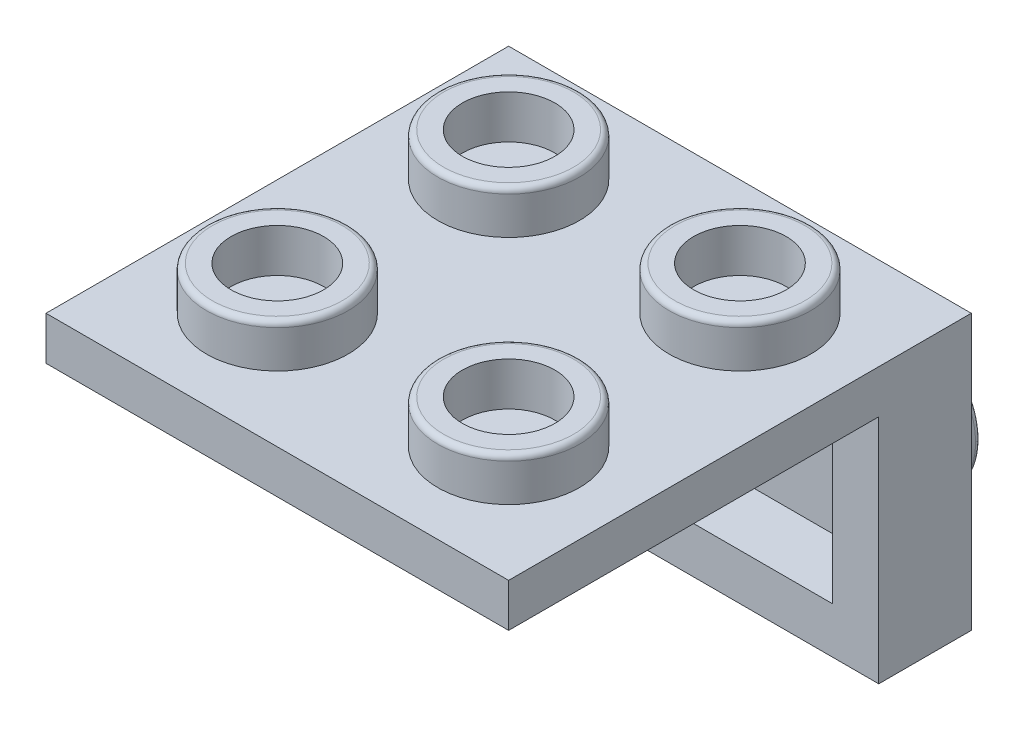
ISO-10303-21;
HEADER;
FILE_DESCRIPTION(('STEP AP214'),'2;1');
FILE_NAME('part.step','',(''),(''),'','','');
FILE_SCHEMA(('AUTOMOTIVE_DESIGN { 1 0 10303 214 1 1 1 1 }'));
ENDSEC;
DATA;
#1=APPLICATION_CONTEXT('core data for automotive mechanical design processes');
#2=APPLICATION_PROTOCOL_DEFINITION('international standard','automotive_design',2000,#1);
#3=PRODUCT_CONTEXT('',#1,'mechanical');
#4=PRODUCT('Part','Part','',(#3));
#5=PRODUCT_RELATED_PRODUCT_CATEGORY('part','',(#4));
#6=PRODUCT_DEFINITION_FORMATION('','',#4);
#7=PRODUCT_DEFINITION_CONTEXT('part definition',#1,'design');
#8=PRODUCT_DEFINITION('design','',#6,#7);
#9=PRODUCT_DEFINITION_SHAPE('','',#8);
#10=(LENGTH_UNIT() NAMED_UNIT(*) SI_UNIT(.MILLI.,.METRE.));
#11=(NAMED_UNIT(*) PLANE_ANGLE_UNIT() SI_UNIT($,.RADIAN.));
#12=(NAMED_UNIT(*) SI_UNIT($,.STERADIAN.) SOLID_ANGLE_UNIT());
#13=UNCERTAINTY_MEASURE_WITH_UNIT(LENGTH_MEASURE(1.E-05),#10,'distance_accuracy_value','');
#14=(GEOMETRIC_REPRESENTATION_CONTEXT(3) GLOBAL_UNCERTAINTY_ASSIGNED_CONTEXT((#13)) GLOBAL_UNIT_ASSIGNED_CONTEXT((#10,
#11,#12)) REPRESENTATION_CONTEXT('',''));
#15=CARTESIAN_POINT('',(0.,0.,0.));
#16=DIRECTION('',(0.,0.,1.));
#17=DIRECTION('',(1.,0.,0.));
#18=AXIS2_PLACEMENT_3D('',#15,#16,#17);
#19=CARTESIAN_POINT('',(-16.,1.5,0.));
#20=DIRECTION('',(0.,1.,0.));
#21=DIRECTION('',(-1.,0.,0.));
#22=AXIS2_PLACEMENT_3D('',#19,#20,#21);
#23=PLANE('',#22);
#24=DIRECTION('',(0.,0.,1.));
#25=VECTOR('',#24,1.);
#26=CARTESIAN_POINT('',(-16.,1.5,0.));
#27=LINE('',#26,#25);
#28=CARTESIAN_POINT('',(-16.,1.5,0.));
#29=VERTEX_POINT('',#28);
#30=CARTESIAN_POINT('',(-16.,1.5,16.));
#31=VERTEX_POINT('',#30);
#32=EDGE_CURVE('E146',#29,#31,#27,.T.);
#33=ORIENTED_EDGE('',*,*,#32,.T.);
#34=DIRECTION('',(1.,0.,0.));
#35=VECTOR('',#34,1.);
#36=CARTESIAN_POINT('',(-16.,1.5,16.));
#37=LINE('',#36,#35);
#38=CARTESIAN_POINT('',(0.,1.5,16.));
#39=VERTEX_POINT('',#38);
#40=EDGE_CURVE('E127',#31,#39,#37,.T.);
#41=ORIENTED_EDGE('',*,*,#40,.T.);
#42=DIRECTION('',(0.,0.,-1.));
#43=VECTOR('',#42,1.);
#44=CARTESIAN_POINT('',(0.,1.5,0.));
#45=LINE('',#44,#43);
#46=CARTESIAN_POINT('',(0.,1.5,0.));
#47=VERTEX_POINT('',#46);
#48=EDGE_CURVE('E149',#39,#47,#45,.T.);
#49=ORIENTED_EDGE('',*,*,#48,.T.);
#50=DIRECTION('',(-1.,0.,0.));
#51=VECTOR('',#50,1.);
#52=CARTESIAN_POINT('',(-16.,1.5,0.));
#53=LINE('',#52,#51);
#54=EDGE_CURVE('E135',#47,#29,#53,.T.);
#55=ORIENTED_EDGE('',*,*,#54,.T.);
#56=EDGE_LOOP('',(#33,#41,#49,#55));
#57=FACE_BOUND('',#56,.T.);
#58=CARTESIAN_POINT('',(-12.,1.5,4.));
#59=DIRECTION('',(0.,1.,0.));
#60=DIRECTION('',(-1.,0.,0.));
#61=AXIS2_PLACEMENT_3D('',#58,#59,#60);
#62=CIRCLE('',#61,2.45);
#63=CARTESIAN_POINT('',(-14.45,1.5,4.));
#64=VERTEX_POINT('',#63);
#65=EDGE_CURVE('E116',#64,#64,#62,.T.);
#66=ORIENTED_EDGE('',*,*,#65,.F.);
#67=EDGE_LOOP('',(#66));
#68=FACE_BOUND('',#67,.T.);
#69=CARTESIAN_POINT('',(-12.,1.5,12.));
#70=DIRECTION('',(0.,1.,0.));
#71=DIRECTION('',(-1.,0.,0.));
#72=AXIS2_PLACEMENT_3D('',#69,#70,#71);
#73=CIRCLE('',#72,2.45);
#74=CARTESIAN_POINT('',(-14.45,1.5,12.));
#75=VERTEX_POINT('',#74);
#76=EDGE_CURVE('E647',#75,#75,#73,.T.);
#77=ORIENTED_EDGE('',*,*,#76,.F.);
#78=EDGE_LOOP('',(#77));
#79=FACE_BOUND('',#78,.T.);
#80=CARTESIAN_POINT('',(-4.,1.5,4.));
#81=DIRECTION('',(0.,1.,0.));
#82=DIRECTION('',(-1.,0.,0.));
#83=AXIS2_PLACEMENT_3D('',#80,#81,#82);
#84=CIRCLE('',#83,2.45);
#85=CARTESIAN_POINT('',(-6.45,1.5,4.));
#86=VERTEX_POINT('',#85);
#87=EDGE_CURVE('E648',#86,#86,#84,.T.);
#88=ORIENTED_EDGE('',*,*,#87,.F.);
#89=EDGE_LOOP('',(#88));
#90=FACE_BOUND('',#89,.T.);
#91=CARTESIAN_POINT('',(-4.,1.5,12.));
#92=DIRECTION('',(0.,1.,0.));
#93=DIRECTION('',(-1.,0.,0.));
#94=AXIS2_PLACEMENT_3D('',#91,#92,#93);
#95=CIRCLE('',#94,2.45);
#96=CARTESIAN_POINT('',(-6.45,1.5,12.));
#97=VERTEX_POINT('',#96);
#98=EDGE_CURVE('E669',#97,#97,#95,.T.);
#99=ORIENTED_EDGE('',*,*,#98,.F.);
#100=EDGE_LOOP('',(#99));
#101=FACE_BOUND('',#100,.T.);
#102=ADVANCED_FACE('F27',(#57,#68,#79,#90,#101),#23,.T.);
#103=CARTESIAN_POINT('',(-1.6,-1.6,1.1));
#104=DIRECTION('',(0.,0.,1.));
#105=DIRECTION('',(1.,0.,0.));
#106=AXIS2_PLACEMENT_3D('',#103,#104,#105);
#107=PLANE('',#106);
#108=DIRECTION('',(0.,1.,0.));
#109=VECTOR('',#108,1.);
#110=CARTESIAN_POINT('',(-1.6,-6.4,1.1));
#111=LINE('',#110,#109);
#112=CARTESIAN_POINT('',(-1.6,-6.4,1.1));
#113=VERTEX_POINT('',#112);
#114=CARTESIAN_POINT('',(-1.6,-1.6,1.1));
#115=VERTEX_POINT('',#114);
#116=EDGE_CURVE('E414',#113,#115,#111,.T.);
#117=ORIENTED_EDGE('',*,*,#116,.T.);
#118=DIRECTION('',(-1.,0.,0.));
#119=VECTOR('',#118,1.);
#120=CARTESIAN_POINT('',(-1.6,-1.6,1.1));
#121=LINE('',#120,#119);
#122=CARTESIAN_POINT('',(-14.4,-1.6,1.1));
#123=VERTEX_POINT('',#122);
#124=EDGE_CURVE('E411',#115,#123,#121,.T.);
#125=ORIENTED_EDGE('',*,*,#124,.T.);
#126=DIRECTION('',(0.,-1.,0.));
#127=VECTOR('',#126,1.);
#128=CARTESIAN_POINT('',(-14.4,-6.4,1.1));
#129=LINE('',#128,#127);
#130=CARTESIAN_POINT('',(-14.4,-6.4,1.1));
#131=VERTEX_POINT('',#130);
#132=EDGE_CURVE('E408',#123,#131,#129,.T.);
#133=ORIENTED_EDGE('',*,*,#132,.T.);
#134=DIRECTION('',(1.,0.,0.));
#135=VECTOR('',#134,1.);
#136=CARTESIAN_POINT('',(-1.6,-6.4,1.1));
#137=LINE('',#136,#135);
#138=EDGE_CURVE('E403',#131,#113,#137,.T.);
#139=ORIENTED_EDGE('',*,*,#138,.T.);
#140=EDGE_LOOP('',(#117,#125,#133,#139));
#141=FACE_BOUND('',#140,.T.);
#142=CARTESIAN_POINT('',(-7.9128281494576,-3.82752633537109,1.1));
#143=DIRECTION('',(0.,0.,1.));
#144=DIRECTION('',(1.,0.,0.));
#145=AXIS2_PLACEMENT_3D('',#142,#143,#144);
#146=CIRCLE('',#145,1.5);
#147=CARTESIAN_POINT('',(-6.4128281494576,-3.82752633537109,1.1));
#148=VERTEX_POINT('',#147);
#149=EDGE_CURVE('E133',#148,#148,#146,.T.);
#150=ORIENTED_EDGE('',*,*,#149,.F.);
#151=EDGE_LOOP('',(#150));
#152=FACE_BOUND('',#151,.T.);
#153=ADVANCED_FACE('F240',(#141,#152),#107,.T.);
#154=CARTESIAN_POINT('',(0.,0.,0.));
#155=DIRECTION('',(0.,0.,-1.));
#156=DIRECTION('',(-1.,0.,0.));
#157=AXIS2_PLACEMENT_3D('',#154,#155,#156);
#158=PLANE('',#157);
#159=CARTESIAN_POINT('',(-4.,-4.,0.));
#160=DIRECTION('',(0.,0.,-1.));
#161=DIRECTION('',(-1.,0.,0.));
#162=AXIS2_PLACEMENT_3D('',#159,#160,#161);
#163=CIRCLE('',#162,2.45);
#164=CARTESIAN_POINT('',(-1.55,-4.,0.));
#165=VERTEX_POINT('',#164);
#166=EDGE_CURVE('E427',#165,#165,#163,.T.);
#167=ORIENTED_EDGE('',*,*,#166,.F.);
#168=EDGE_LOOP('',(#167));
#169=FACE_BOUND('',#168,.T.);
#170=DIRECTION('',(0.,1.,0.));
#171=VECTOR('',#170,1.);
#172=CARTESIAN_POINT('',(0.,0.,0.));
#173=LINE('',#172,#171);
#174=CARTESIAN_POINT('',(0.,-8.,0.));
#175=VERTEX_POINT('',#174);
#176=EDGE_CURVE('E163',#175,#47,#173,.T.);
#177=ORIENTED_EDGE('',*,*,#176,.F.);
#178=DIRECTION('',(1.,0.,0.));
#179=VECTOR('',#178,1.);
#180=CARTESIAN_POINT('',(0.,-8.,0.));
#181=LINE('',#180,#179);
#182=CARTESIAN_POINT('',(-16.,-8.,0.));
#183=VERTEX_POINT('',#182);
#184=EDGE_CURVE('E162',#183,#175,#181,.T.);
#185=ORIENTED_EDGE('',*,*,#184,.F.);
#186=DIRECTION('',(0.,-1.,0.));
#187=VECTOR('',#186,1.);
#188=CARTESIAN_POINT('',(-16.,0.,0.));
#189=LINE('',#188,#187);
#190=EDGE_CURVE('E158',#29,#183,#189,.T.);
#191=ORIENTED_EDGE('',*,*,#190,.F.);
#192=ORIENTED_EDGE('',*,*,#54,.F.);
#193=EDGE_LOOP('',(#177,#185,#191,#192));
#194=FACE_BOUND('',#193,.T.);
#195=CARTESIAN_POINT('',(-12.,-4.,0.));
#196=DIRECTION('',(0.,0.,-1.));
#197=DIRECTION('',(-1.,0.,0.));
#198=AXIS2_PLACEMENT_3D('',#195,#196,#197);
#199=CIRCLE('',#198,2.45);
#200=CARTESIAN_POINT('',(-9.55,-4.,0.));
#201=VERTEX_POINT('',#200);
#202=EDGE_CURVE('E436',#201,#201,#199,.T.);
#203=ORIENTED_EDGE('',*,*,#202,.F.);
#204=EDGE_LOOP('',(#203));
#205=FACE_BOUND('',#204,.T.);
#206=ADVANCED_FACE('F171',(#169,#194,#205),#158,.T.);
#207=CARTESIAN_POINT('',(0.,0.,3.2));
#208=DIRECTION('',(-1.,0.,0.));
#209=DIRECTION('',(0.,-1.,0.));
#210=AXIS2_PLACEMENT_3D('',#207,#208,#209);
#211=PLANE('',#210);
#212=ORIENTED_EDGE('',*,*,#176,.T.);
#213=ORIENTED_EDGE('',*,*,#48,.F.);
#214=DIRECTION('',(0.,-1.,0.));
#215=VECTOR('',#214,1.);
#216=CARTESIAN_POINT('',(0.,1.5,16.));
#217=LINE('',#216,#215);
#218=CARTESIAN_POINT('',(0.,0.,16.));
#219=VERTEX_POINT('',#218);
#220=EDGE_CURVE('E130',#39,#219,#217,.T.);
#221=ORIENTED_EDGE('',*,*,#220,.T.);
#222=DIRECTION('',(0.,0.,-1.));
#223=VECTOR('',#222,1.);
#224=CARTESIAN_POINT('',(0.,0.,0.));
#225=LINE('',#224,#223);
#226=CARTESIAN_POINT('',(0.,0.,3.2));
#227=VERTEX_POINT('',#226);
#228=EDGE_CURVE('E121',#219,#227,#225,.T.);
#229=ORIENTED_EDGE('',*,*,#228,.T.);
#230=DIRECTION('',(0.,1.,0.));
#231=VECTOR('',#230,1.);
#232=CARTESIAN_POINT('',(0.,0.,3.2));
#233=LINE('',#232,#231);
#234=CARTESIAN_POINT('',(0.,-8.,3.2));
#235=VERTEX_POINT('',#234);
#236=EDGE_CURVE('E173',#235,#227,#233,.T.);
#237=ORIENTED_EDGE('',*,*,#236,.F.);
#238=DIRECTION('',(0.,0.,-1.));
#239=VECTOR('',#238,1.);
#240=CARTESIAN_POINT('',(0.,-8.,3.2));
#241=LINE('',#240,#239);
#242=EDGE_CURVE('E169',#235,#175,#241,.T.);
#243=ORIENTED_EDGE('',*,*,#242,.T.);
#244=EDGE_LOOP('',(#212,#213,#221,#229,#237,#243));
#245=FACE_BOUND('',#244,.T.);
#246=ADVANCED_FACE('F29',(#245),#211,.F.);
#247=CARTESIAN_POINT('',(-16.,0.,3.2));
#248=DIRECTION('',(1.,0.,0.));
#249=DIRECTION('',(0.,0.,-1.));
#250=AXIS2_PLACEMENT_3D('',#247,#248,#249);
#251=PLANE('',#250);
#252=ORIENTED_EDGE('',*,*,#190,.T.);
#253=DIRECTION('',(0.,0.,-1.));
#254=VECTOR('',#253,1.);
#255=CARTESIAN_POINT('',(-16.,-8.,3.2));
#256=LINE('',#255,#254);
#257=CARTESIAN_POINT('',(-16.,-8.,3.2));
#258=VERTEX_POINT('',#257);
#259=EDGE_CURVE('E160',#258,#183,#256,.T.);
#260=ORIENTED_EDGE('',*,*,#259,.F.);
#261=DIRECTION('',(0.,-1.,0.));
#262=VECTOR('',#261,1.);
#263=CARTESIAN_POINT('',(-16.,0.,3.2));
#264=LINE('',#263,#262);
#265=CARTESIAN_POINT('',(-16.,0.,3.2));
#266=VERTEX_POINT('',#265);
#267=EDGE_CURVE('E112',#266,#258,#264,.T.);
#268=ORIENTED_EDGE('',*,*,#267,.F.);
#269=DIRECTION('',(0.,0.,1.));
#270=VECTOR('',#269,1.);
#271=CARTESIAN_POINT('',(-16.,0.,0.));
#272=LINE('',#271,#270);
#273=CARTESIAN_POINT('',(-16.,0.,16.));
#274=VERTEX_POINT('',#273);
#275=EDGE_CURVE('E105',#266,#274,#272,.T.);
#276=ORIENTED_EDGE('',*,*,#275,.T.);
#277=DIRECTION('',(0.,-1.,0.));
#278=VECTOR('',#277,1.);
#279=CARTESIAN_POINT('',(-16.,1.5,16.));
#280=LINE('',#279,#278);
#281=EDGE_CURVE('E110',#31,#274,#280,.T.);
#282=ORIENTED_EDGE('',*,*,#281,.F.);
#283=ORIENTED_EDGE('',*,*,#32,.F.);
#284=EDGE_LOOP('',(#252,#260,#268,#276,#282,#283));
#285=FACE_BOUND('',#284,.T.);
#286=ADVANCED_FACE('F107',(#285),#251,.F.);
#287=CARTESIAN_POINT('',(0.,-8.,3.2));
#288=DIRECTION('',(0.,1.,0.));
#289=DIRECTION('',(-1.,0.,0.));
#290=AXIS2_PLACEMENT_3D('',#287,#288,#289);
#291=PLANE('',#290);
#292=ORIENTED_EDGE('',*,*,#184,.T.);
#293=ORIENTED_EDGE('',*,*,#242,.F.);
#294=DIRECTION('',(1.,0.,0.));
#295=VECTOR('',#294,1.);
#296=CARTESIAN_POINT('',(0.,-8.,3.2));
#297=LINE('',#296,#295);
#298=EDGE_CURVE('E50',#258,#235,#297,.T.);
#299=ORIENTED_EDGE('',*,*,#298,.F.);
#300=ORIENTED_EDGE('',*,*,#259,.T.);
#301=EDGE_LOOP('',(#292,#293,#299,#300));
#302=FACE_BOUND('',#301,.T.);
#303=ADVANCED_FACE('F166',(#302),#291,.F.);
#304=CARTESIAN_POINT('',(0.,0.,3.2));
#305=DIRECTION('',(0.,0.,-1.));
#306=DIRECTION('',(-1.,0.,0.));
#307=AXIS2_PLACEMENT_3D('',#304,#305,#306);
#308=PLANE('',#307);
#309=DIRECTION('',(-1.,0.,0.));
#310=VECTOR('',#309,1.);
#311=CARTESIAN_POINT('',(-1.6,-1.6,3.2));
#312=LINE('',#311,#310);
#313=CARTESIAN_POINT('',(-1.6,-1.6,3.2));
#314=VERTEX_POINT('',#313);
#315=CARTESIAN_POINT('',(-14.4,-1.6,3.2));
#316=VERTEX_POINT('',#315);
#317=EDGE_CURVE('E423',#314,#316,#312,.T.);
#318=ORIENTED_EDGE('',*,*,#317,.F.);
#319=DIRECTION('',(0.,1.,0.));
#320=VECTOR('',#319,1.);
#321=CARTESIAN_POINT('',(-1.6,-6.4,3.2));
#322=LINE('',#321,#320);
#323=CARTESIAN_POINT('',(-1.6,-6.4,3.2));
#324=VERTEX_POINT('',#323);
#325=EDGE_CURVE('E42',#324,#314,#322,.T.);
#326=ORIENTED_EDGE('',*,*,#325,.F.);
#327=DIRECTION('',(1.,0.,0.));
#328=VECTOR('',#327,1.);
#329=CARTESIAN_POINT('',(-1.6,-6.4,3.2));
#330=LINE('',#329,#328);
#331=CARTESIAN_POINT('',(-14.4,-6.4,3.2));
#332=VERTEX_POINT('',#331);
#333=EDGE_CURVE('E417',#332,#324,#330,.T.);
#334=ORIENTED_EDGE('',*,*,#333,.F.);
#335=DIRECTION('',(0.,-1.,0.));
#336=VECTOR('',#335,1.);
#337=CARTESIAN_POINT('',(-14.4,-6.4,3.2));
#338=LINE('',#337,#336);
#339=EDGE_CURVE('E420',#316,#332,#338,.T.);
#340=ORIENTED_EDGE('',*,*,#339,.F.);
#341=EDGE_LOOP('',(#318,#326,#334,#340));
#342=FACE_BOUND('',#341,.T.);
#343=ORIENTED_EDGE('',*,*,#236,.T.);
#344=DIRECTION('',(-1.,0.,0.));
#345=VECTOR('',#344,1.);
#346=CARTESIAN_POINT('',(0.,0.,3.2));
#347=LINE('',#346,#345);
#348=EDGE_CURVE('E175',#227,#266,#347,.T.);
#349=ORIENTED_EDGE('',*,*,#348,.T.);
#350=ORIENTED_EDGE('',*,*,#267,.T.);
#351=ORIENTED_EDGE('',*,*,#298,.T.);
#352=EDGE_LOOP('',(#343,#349,#350,#351));
#353=FACE_BOUND('',#352,.T.);
#354=ADVANCED_FACE('F381',(#342,#353),#308,.F.);
#355=CARTESIAN_POINT('',(-1.6,-6.4,1.1));
#356=DIRECTION('',(1.,0.,0.));
#357=DIRECTION('',(0.,0.,-1.));
#358=AXIS2_PLACEMENT_3D('',#355,#356,#357);
#359=PLANE('',#358);
#360=ORIENTED_EDGE('',*,*,#325,.T.);
#361=DIRECTION('',(0.,0.,1.));
#362=VECTOR('',#361,1.);
#363=CARTESIAN_POINT('',(-1.6,-1.6,1.1));
#364=LINE('',#363,#362);
#365=EDGE_CURVE('E400',#115,#314,#364,.T.);
#366=ORIENTED_EDGE('',*,*,#365,.F.);
#367=ORIENTED_EDGE('',*,*,#116,.F.);
#368=DIRECTION('',(0.,0.,1.));
#369=VECTOR('',#368,1.);
#370=CARTESIAN_POINT('',(-1.6,-6.4,1.1));
#371=LINE('',#370,#369);
#372=EDGE_CURVE('E396',#113,#324,#371,.T.);
#373=ORIENTED_EDGE('',*,*,#372,.T.);
#374=EDGE_LOOP('',(#360,#366,#367,#373));
#375=FACE_BOUND('',#374,.T.);
#376=ADVANCED_FACE('F371',(#375),#359,.F.);
#377=CARTESIAN_POINT('',(-1.6,-6.4,1.1));
#378=DIRECTION('',(0.,-1.,0.));
#379=DIRECTION('',(1.,0.,0.));
#380=AXIS2_PLACEMENT_3D('',#377,#378,#379);
#381=PLANE('',#380);
#382=ORIENTED_EDGE('',*,*,#333,.T.);
#383=ORIENTED_EDGE('',*,*,#372,.F.);
#384=ORIENTED_EDGE('',*,*,#138,.F.);
#385=DIRECTION('',(0.,0.,1.));
#386=VECTOR('',#385,1.);
#387=CARTESIAN_POINT('',(-14.4,-6.4,1.1));
#388=LINE('',#387,#386);
#389=EDGE_CURVE('E397',#131,#332,#388,.T.);
#390=ORIENTED_EDGE('',*,*,#389,.T.);
#391=EDGE_LOOP('',(#382,#383,#384,#390));
#392=FACE_BOUND('',#391,.T.);
#393=ADVANCED_FACE('F367',(#392),#381,.F.);
#394=CARTESIAN_POINT('',(-14.4,-6.4,1.1));
#395=DIRECTION('',(-1.,0.,0.));
#396=DIRECTION('',(0.,-1.,0.));
#397=AXIS2_PLACEMENT_3D('',#394,#395,#396);
#398=PLANE('',#397);
#399=ORIENTED_EDGE('',*,*,#339,.T.);
#400=ORIENTED_EDGE('',*,*,#389,.F.);
#401=ORIENTED_EDGE('',*,*,#132,.F.);
#402=DIRECTION('',(0.,0.,1.));
#403=VECTOR('',#402,1.);
#404=CARTESIAN_POINT('',(-14.4,-1.6,1.1));
#405=LINE('',#404,#403);
#406=EDGE_CURVE('E402',#123,#316,#405,.T.);
#407=ORIENTED_EDGE('',*,*,#406,.T.);
#408=EDGE_LOOP('',(#399,#400,#401,#407));
#409=FACE_BOUND('',#408,.T.);
#410=ADVANCED_FACE('F370',(#409),#398,.F.);
#411=CARTESIAN_POINT('',(-1.6,-1.6,1.1));
#412=DIRECTION('',(0.,1.,0.));
#413=DIRECTION('',(-1.,0.,0.));
#414=AXIS2_PLACEMENT_3D('',#411,#412,#413);
#415=PLANE('',#414);
#416=ORIENTED_EDGE('',*,*,#317,.T.);
#417=ORIENTED_EDGE('',*,*,#406,.F.);
#418=ORIENTED_EDGE('',*,*,#124,.F.);
#419=ORIENTED_EDGE('',*,*,#365,.T.);
#420=EDGE_LOOP('',(#416,#417,#418,#419));
#421=FACE_BOUND('',#420,.T.);
#422=ADVANCED_FACE('F364',(#421),#415,.F.);
#423=CARTESIAN_POINT('',(-4.,-4.,-1.9));
#424=DIRECTION('',(0.,0.,1.));
#425=DIRECTION('',(1.,0.,0.));
#426=AXIS2_PLACEMENT_3D('',#423,#424,#425);
#427=CYLINDRICAL_SURFACE('',#426,2.45);
#428=CARTESIAN_POINT('',(-4.,-4.,-1.7));
#429=DIRECTION('',(0.,0.,-1.));
#430=DIRECTION('',(-1.,0.,0.));
#431=AXIS2_PLACEMENT_3D('',#428,#429,#430);
#432=CIRCLE('',#431,2.45);
#433=CARTESIAN_POINT('',(-1.55,-4.,-1.7));
#434=VERTEX_POINT('',#433);
#435=EDGE_CURVE('E452',#434,#434,#432,.F.);
#436=CARTESIAN_POINT('',(-1.55,-4.,-1.7));
#437=CARTESIAN_POINT('',(-1.55,-4.,-1.68229166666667));
#438=CARTESIAN_POINT('',(-1.55,-4.,-1.66458333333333));
#439=CARTESIAN_POINT('',(-1.55,-4.,-1.62916666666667));
#440=CARTESIAN_POINT('',(-1.55,-4.,-1.61145833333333));
#441=CARTESIAN_POINT('',(-1.55,-4.,-1.57604166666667));
#442=CARTESIAN_POINT('',(-1.55,-4.,-1.55833333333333));
#443=CARTESIAN_POINT('',(-1.55,-4.,-1.52291666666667));
#444=CARTESIAN_POINT('',(-1.55,-4.,-1.50520833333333));
#445=CARTESIAN_POINT('',(-1.55,-4.,-1.46979166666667));
#446=CARTESIAN_POINT('',(-1.55,-4.,-1.45208333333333));
#447=CARTESIAN_POINT('',(-1.55,-4.,-1.41666666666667));
#448=CARTESIAN_POINT('',(-1.55,-4.,-1.39895833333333));
#449=CARTESIAN_POINT('',(-1.55,-4.,-1.36354166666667));
#450=CARTESIAN_POINT('',(-1.55,-4.,-1.34583333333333));
#451=CARTESIAN_POINT('',(-1.55,-4.,-1.31041666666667));
#452=CARTESIAN_POINT('',(-1.55,-4.,-1.29270833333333));
#453=CARTESIAN_POINT('',(-1.55,-4.,-1.25729166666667));
#454=CARTESIAN_POINT('',(-1.55,-4.,-1.23958333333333));
#455=CARTESIAN_POINT('',(-1.55,-4.,-1.20416666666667));
#456=CARTESIAN_POINT('',(-1.55,-4.,-1.18645833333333));
#457=CARTESIAN_POINT('',(-1.55,-4.,-1.15104166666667));
#458=CARTESIAN_POINT('',(-1.55,-4.,-1.13333333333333));
#459=CARTESIAN_POINT('',(-1.55,-4.,-1.09791666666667));
#460=CARTESIAN_POINT('',(-1.55,-4.,-1.08020833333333));
#461=CARTESIAN_POINT('',(-1.55,-4.,-1.04479166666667));
#462=CARTESIAN_POINT('',(-1.55,-4.,-1.02708333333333));
#463=CARTESIAN_POINT('',(-1.55,-4.,-0.991666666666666));
#464=CARTESIAN_POINT('',(-1.55,-4.,-0.973958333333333));
#465=CARTESIAN_POINT('',(-1.55,-4.,-0.938541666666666));
#466=CARTESIAN_POINT('',(-1.55,-4.,-0.920833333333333));
#467=CARTESIAN_POINT('',(-1.55,-4.,-0.885416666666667));
#468=CARTESIAN_POINT('',(-1.55,-4.,-0.867708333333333));
#469=CARTESIAN_POINT('',(-1.55,-4.,-0.832291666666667));
#470=CARTESIAN_POINT('',(-1.55,-4.,-0.814583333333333));
#471=CARTESIAN_POINT('',(-1.55,-4.,-0.779166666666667));
#472=CARTESIAN_POINT('',(-1.55,-4.,-0.761458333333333));
#473=CARTESIAN_POINT('',(-1.55,-4.,-0.726041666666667));
#474=CARTESIAN_POINT('',(-1.55,-4.,-0.708333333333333));
#475=CARTESIAN_POINT('',(-1.55,-4.,-0.672916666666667));
#476=CARTESIAN_POINT('',(-1.55,-4.,-0.655208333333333));
#477=CARTESIAN_POINT('',(-1.55,-4.,-0.619791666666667));
#478=CARTESIAN_POINT('',(-1.55,-4.,-0.602083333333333));
#479=CARTESIAN_POINT('',(-1.55,-4.,-0.566666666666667));
#480=CARTESIAN_POINT('',(-1.55,-4.,-0.548958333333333));
#481=CARTESIAN_POINT('',(-1.55,-4.,-0.513541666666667));
#482=CARTESIAN_POINT('',(-1.55,-4.,-0.495833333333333));
#483=CARTESIAN_POINT('',(-1.55,-4.,-0.460416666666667));
#484=CARTESIAN_POINT('',(-1.55,-4.,-0.442708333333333));
#485=CARTESIAN_POINT('',(-1.55,-4.,-0.407291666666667));
#486=CARTESIAN_POINT('',(-1.55,-4.,-0.389583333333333));
#487=CARTESIAN_POINT('',(-1.55,-4.,-0.354166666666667));
#488=CARTESIAN_POINT('',(-1.55,-4.,-0.336458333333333));
#489=CARTESIAN_POINT('',(-1.55,-4.,-0.301041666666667));
#490=CARTESIAN_POINT('',(-1.55,-4.,-0.283333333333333));
#491=CARTESIAN_POINT('',(-1.55,-4.,-0.247916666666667));
#492=CARTESIAN_POINT('',(-1.55,-4.,-0.230208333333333));
#493=CARTESIAN_POINT('',(-1.55,-4.,-0.194791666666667));
#494=CARTESIAN_POINT('',(-1.55,-4.,-0.177083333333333));
#495=CARTESIAN_POINT('',(-1.55,-4.,-0.141666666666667));
#496=CARTESIAN_POINT('',(-1.55,-4.,-0.123958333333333));
#497=CARTESIAN_POINT('',(-1.55,-4.,-0.0885416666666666));
#498=CARTESIAN_POINT('',(-1.55,-4.,-0.0708333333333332));
#499=CARTESIAN_POINT('',(-1.55,-4.,-0.0354166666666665));
#500=CARTESIAN_POINT('',(-1.55,-4.,-0.0177083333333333));
#501=CARTESIAN_POINT('',(-1.55,-4.,0.));
#502=B_SPLINE_CURVE_WITH_KNOTS('',3,(#436,#437,#438,#439,#440,#441,#442,#443,#444,#445,#446,
#447,#448,#449,#450,#451,#452,#453,#454,#455,#456,#457,#458,#459,#460,#461,#462,#463,#464,#465,
#466,#467,#468,#469,#470,#471,#472,#473,#474,#475,#476,#477,#478,#479,#480,#481,#482,#483,#484,
#485,#486,#487,#488,#489,#490,#491,#492,#493,#494,#495,#496,#497,#498,#499,#500,#501),
.UNSPECIFIED.,.F.,.F.,(4,2,2,2,2,2,2,2,2,2,2,2,2,2,2,2,2,2,2,2,2,2,2,2,2,2,2,2,2,2,2,2,4),(0.,
0.053125,0.10625,0.159375,0.2125,0.265625,0.31875,0.371875,0.425,0.478125,0.53125,0.584375,
0.6375,0.690625,0.74375,0.796875,0.85,0.903125,0.95625,1.009375,1.0625,1.115625,1.16875,
1.221875,1.275,1.328125,1.38125,1.434375,1.4875,1.540625,1.59375,1.646875,1.7),.UNSPECIFIED.);
#503=EDGE_CURVE('BSEAM361',#434,#165,#502,.T.);
#504=ORIENTED_EDGE('',*,*,#435,.T.);
#505=ORIENTED_EDGE('',*,*,#166,.T.);
#506=ORIENTED_EDGE('',*,*,#503,.T.);
#507=ORIENTED_EDGE('',*,*,#503,.F.);
#508=EDGE_LOOP('',(#504,#506,#505,#507));
#509=FACE_BOUND('',#508,.T.);
#510=ADVANCED_FACE('F361',(#509),#427,.T.);
#511=CARTESIAN_POINT('',(-4.,-4.,-1.9));
#512=DIRECTION('',(0.,0.,-1.));
#513=DIRECTION('',(-1.,0.,0.));
#514=AXIS2_PLACEMENT_3D('',#511,#512,#513);
#515=PLANE('',#514);
#516=CARTESIAN_POINT('',(-4.,-4.,-1.9));
#517=DIRECTION('',(0.,0.,-1.));
#518=DIRECTION('',(-1.,0.,0.));
#519=AXIS2_PLACEMENT_3D('',#516,#517,#518);
#520=CIRCLE('',#519,2.25);
#521=CARTESIAN_POINT('',(-6.25,-4.,-1.9));
#522=VERTEX_POINT('',#521);
#523=EDGE_CURVE('E168',#522,#522,#520,.T.);
#524=ORIENTED_EDGE('',*,*,#523,.T.);
#525=EDGE_LOOP('',(#524));
#526=FACE_BOUND('',#525,.T.);
#527=ADVANCED_FACE('F357',(#526),#515,.T.);
#528=CARTESIAN_POINT('',(-4.,-4.,-1.7));
#529=DIRECTION('',(0.,0.,-1.));
#530=DIRECTION('',(-1.,0.,0.));
#531=AXIS2_PLACEMENT_3D('',#528,#529,#530);
#532=TOROIDAL_SURFACE('',#531,2.25,0.2);
#533=ORIENTED_EDGE('',*,*,#435,.F.);
#534=EDGE_LOOP('',(#533));
#535=FACE_BOUND('',#534,.T.);
#536=ORIENTED_EDGE('',*,*,#523,.F.);
#537=EDGE_LOOP('',(#536));
#538=FACE_BOUND('',#537,.T.);
#539=ADVANCED_FACE('F348',(#535,#538),#532,.T.);
#540=CARTESIAN_POINT('',(-12.,-4.,-1.9));
#541=DIRECTION('',(0.,0.,1.));
#542=DIRECTION('',(1.,0.,0.));
#543=AXIS2_PLACEMENT_3D('',#540,#541,#542);
#544=CYLINDRICAL_SURFACE('',#543,2.45);
#545=CARTESIAN_POINT('',(-12.,-4.,-1.7));
#546=DIRECTION('',(0.,0.,-1.));
#547=DIRECTION('',(-1.,0.,0.));
#548=AXIS2_PLACEMENT_3D('',#545,#546,#547);
#549=CIRCLE('',#548,2.45);
#550=CARTESIAN_POINT('',(-9.55,-4.,-1.7));
#551=VERTEX_POINT('',#550);
#552=EDGE_CURVE('E433',#551,#551,#549,.F.);
#553=CARTESIAN_POINT('',(-9.55,-4.,-1.7));
#554=CARTESIAN_POINT('',(-9.55,-4.,-1.68229166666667));
#555=CARTESIAN_POINT('',(-9.55,-4.,-1.66458333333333));
#556=CARTESIAN_POINT('',(-9.55,-4.,-1.62916666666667));
#557=CARTESIAN_POINT('',(-9.55,-4.,-1.61145833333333));
#558=CARTESIAN_POINT('',(-9.55,-4.,-1.57604166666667));
#559=CARTESIAN_POINT('',(-9.55,-4.,-1.55833333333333));
#560=CARTESIAN_POINT('',(-9.55,-4.,-1.52291666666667));
#561=CARTESIAN_POINT('',(-9.55,-4.,-1.50520833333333));
#562=CARTESIAN_POINT('',(-9.55,-4.,-1.46979166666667));
#563=CARTESIAN_POINT('',(-9.55,-4.,-1.45208333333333));
#564=CARTESIAN_POINT('',(-9.55,-4.,-1.41666666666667));
#565=CARTESIAN_POINT('',(-9.55,-4.,-1.39895833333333));
#566=CARTESIAN_POINT('',(-9.55,-4.,-1.36354166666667));
#567=CARTESIAN_POINT('',(-9.55,-4.,-1.34583333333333));
#568=CARTESIAN_POINT('',(-9.55,-4.,-1.31041666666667));
#569=CARTESIAN_POINT('',(-9.55,-4.,-1.29270833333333));
#570=CARTESIAN_POINT('',(-9.55,-4.,-1.25729166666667));
#571=CARTESIAN_POINT('',(-9.55,-4.,-1.23958333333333));
#572=CARTESIAN_POINT('',(-9.55,-4.,-1.20416666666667));
#573=CARTESIAN_POINT('',(-9.55,-4.,-1.18645833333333));
#574=CARTESIAN_POINT('',(-9.55,-4.,-1.15104166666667));
#575=CARTESIAN_POINT('',(-9.55,-4.,-1.13333333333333));
#576=CARTESIAN_POINT('',(-9.55,-4.,-1.09791666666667));
#577=CARTESIAN_POINT('',(-9.55,-4.,-1.08020833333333));
#578=CARTESIAN_POINT('',(-9.55,-4.,-1.04479166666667));
#579=CARTESIAN_POINT('',(-9.55,-4.,-1.02708333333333));
#580=CARTESIAN_POINT('',(-9.55,-4.,-0.991666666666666));
#581=CARTESIAN_POINT('',(-9.55,-4.,-0.973958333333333));
#582=CARTESIAN_POINT('',(-9.55,-4.,-0.938541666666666));
#583=CARTESIAN_POINT('',(-9.55,-4.,-0.920833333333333));
#584=CARTESIAN_POINT('',(-9.55,-4.,-0.885416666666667));
#585=CARTESIAN_POINT('',(-9.55,-4.,-0.867708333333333));
#586=CARTESIAN_POINT('',(-9.55,-4.,-0.832291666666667));
#587=CARTESIAN_POINT('',(-9.55,-4.,-0.814583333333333));
#588=CARTESIAN_POINT('',(-9.55,-4.,-0.779166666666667));
#589=CARTESIAN_POINT('',(-9.55,-4.,-0.761458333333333));
#590=CARTESIAN_POINT('',(-9.55,-4.,-0.726041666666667));
#591=CARTESIAN_POINT('',(-9.55,-4.,-0.708333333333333));
#592=CARTESIAN_POINT('',(-9.55,-4.,-0.672916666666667));
#593=CARTESIAN_POINT('',(-9.55,-4.,-0.655208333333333));
#594=CARTESIAN_POINT('',(-9.55,-4.,-0.619791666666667));
#595=CARTESIAN_POINT('',(-9.55,-4.,-0.602083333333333));
#596=CARTESIAN_POINT('',(-9.55,-4.,-0.566666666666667));
#597=CARTESIAN_POINT('',(-9.55,-4.,-0.548958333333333));
#598=CARTESIAN_POINT('',(-9.55,-4.,-0.513541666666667));
#599=CARTESIAN_POINT('',(-9.55,-4.,-0.495833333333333));
#600=CARTESIAN_POINT('',(-9.55,-4.,-0.460416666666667));
#601=CARTESIAN_POINT('',(-9.55,-4.,-0.442708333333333));
#602=CARTESIAN_POINT('',(-9.55,-4.,-0.407291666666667));
#603=CARTESIAN_POINT('',(-9.55,-4.,-0.389583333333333));
#604=CARTESIAN_POINT('',(-9.55,-4.,-0.354166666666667));
#605=CARTESIAN_POINT('',(-9.55,-4.,-0.336458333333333));
#606=CARTESIAN_POINT('',(-9.55,-4.,-0.301041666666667));
#607=CARTESIAN_POINT('',(-9.55,-4.,-0.283333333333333));
#608=CARTESIAN_POINT('',(-9.55,-4.,-0.247916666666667));
#609=CARTESIAN_POINT('',(-9.55,-4.,-0.230208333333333));
#610=CARTESIAN_POINT('',(-9.55,-4.,-0.194791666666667));
#611=CARTESIAN_POINT('',(-9.55,-4.,-0.177083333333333));
#612=CARTESIAN_POINT('',(-9.55,-4.,-0.141666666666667));
#613=CARTESIAN_POINT('',(-9.55,-4.,-0.123958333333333));
#614=CARTESIAN_POINT('',(-9.55,-4.,-0.0885416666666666));
#615=CARTESIAN_POINT('',(-9.55,-4.,-0.0708333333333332));
#616=CARTESIAN_POINT('',(-9.55,-4.,-0.0354166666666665));
#617=CARTESIAN_POINT('',(-9.55,-4.,-0.0177083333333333));
#618=CARTESIAN_POINT('',(-9.55,-4.,0.));
#619=B_SPLINE_CURVE_WITH_KNOTS('',3,(#553,#554,#555,#556,#557,#558,#559,#560,#561,#562,#563,
#564,#565,#566,#567,#568,#569,#570,#571,#572,#573,#574,#575,#576,#577,#578,#579,#580,#581,#582,
#583,#584,#585,#586,#587,#588,#589,#590,#591,#592,#593,#594,#595,#596,#597,#598,#599,#600,#601,
#602,#603,#604,#605,#606,#607,#608,#609,#610,#611,#612,#613,#614,#615,#616,#617,#618),
.UNSPECIFIED.,.F.,.F.,(4,2,2,2,2,2,2,2,2,2,2,2,2,2,2,2,2,2,2,2,2,2,2,2,2,2,2,2,2,2,2,2,4),(0.,
0.053125,0.10625,0.159375,0.2125,0.265625,0.31875,0.371875,0.425,0.478125,0.53125,0.584375,
0.6375,0.690625,0.74375,0.796875,0.85,0.903125,0.95625,1.009375,1.0625,1.115625,1.16875,
1.221875,1.275,1.328125,1.38125,1.434375,1.4875,1.540625,1.59375,1.646875,1.7),.UNSPECIFIED.);
#620=EDGE_CURVE('BSEAM340',#551,#201,#619,.T.);
#621=ORIENTED_EDGE('',*,*,#552,.T.);
#622=ORIENTED_EDGE('',*,*,#202,.T.);
#623=ORIENTED_EDGE('',*,*,#620,.T.);
#624=ORIENTED_EDGE('',*,*,#620,.F.);
#625=EDGE_LOOP('',(#621,#623,#622,#624));
#626=FACE_BOUND('',#625,.T.);
#627=ADVANCED_FACE('F340',(#626),#544,.T.);
#628=CARTESIAN_POINT('',(-12.,-4.,-1.9));
#629=DIRECTION('',(0.,0.,-1.));
#630=DIRECTION('',(-1.,0.,0.));
#631=AXIS2_PLACEMENT_3D('',#628,#629,#630);
#632=PLANE('',#631);
#633=CARTESIAN_POINT('',(-12.,-4.,-1.9));
#634=DIRECTION('',(0.,0.,-1.));
#635=DIRECTION('',(-1.,0.,0.));
#636=AXIS2_PLACEMENT_3D('',#633,#634,#635);
#637=CIRCLE('',#636,2.25);
#638=CARTESIAN_POINT('',(-14.25,-4.,-1.9));
#639=VERTEX_POINT('',#638);
#640=EDGE_CURVE('E430',#639,#639,#637,.T.);
#641=ORIENTED_EDGE('',*,*,#640,.T.);
#642=EDGE_LOOP('',(#641));
#643=FACE_BOUND('',#642,.T.);
#644=ADVANCED_FACE('F346',(#643),#632,.T.);
#645=CARTESIAN_POINT('',(-12.,-4.,-1.7));
#646=DIRECTION('',(0.,0.,-1.));
#647=DIRECTION('',(-1.,0.,0.));
#648=AXIS2_PLACEMENT_3D('',#645,#646,#647);
#649=TOROIDAL_SURFACE('',#648,2.25,0.2);
#650=ORIENTED_EDGE('',*,*,#552,.F.);
#651=EDGE_LOOP('',(#650));
#652=FACE_BOUND('',#651,.T.);
#653=ORIENTED_EDGE('',*,*,#640,.F.);
#654=EDGE_LOOP('',(#653));
#655=FACE_BOUND('',#654,.T.);
#656=ADVANCED_FACE('F338',(#652,#655),#649,.T.);
#657=CARTESIAN_POINT('',(-7.9128281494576,-3.82752633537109,3.1));
#658=DIRECTION('',(0.,0.,1.));
#659=DIRECTION('',(1.,0.,0.));
#660=AXIS2_PLACEMENT_3D('',#657,#658,#659);
#661=PLANE('',#660);
#662=CARTESIAN_POINT('',(-7.9128281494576,-3.82752633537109,3.1));
#663=DIRECTION('',(0.,0.,1.));
#664=DIRECTION('',(1.,0.,0.));
#665=AXIS2_PLACEMENT_3D('',#662,#663,#664);
#666=CIRCLE('',#665,1.5);
#667=CARTESIAN_POINT('',(-6.4128281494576,-3.82752633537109,3.1));
#668=VERTEX_POINT('',#667);
#669=EDGE_CURVE('E439',#668,#668,#666,.T.);
#670=ORIENTED_EDGE('',*,*,#669,.T.);
#671=EDGE_LOOP('',(#670));
#672=FACE_BOUND('',#671,.T.);
#673=CARTESIAN_POINT('',(-7.9128281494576,-3.82752633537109,3.1));
#674=DIRECTION('',(0.,0.,1.));
#675=DIRECTION('',(1.,0.,0.));
#676=AXIS2_PLACEMENT_3D('',#673,#674,#675);
#677=CIRCLE('',#676,0.7);
#678=CARTESIAN_POINT('',(-7.2128281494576,-3.82752633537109,3.1));
#679=VERTEX_POINT('',#678);
#680=EDGE_CURVE('E129',#679,#679,#677,.T.);
#681=ORIENTED_EDGE('',*,*,#680,.F.);
#682=EDGE_LOOP('',(#681));
#683=FACE_BOUND('',#682,.T.);
#684=ADVANCED_FACE('F335',(#672,#683),#661,.T.);
#685=CARTESIAN_POINT('',(-7.9128281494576,-3.82752633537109,3.1));
#686=DIRECTION('',(0.,0.,-1.));
#687=DIRECTION('',(-1.,0.,0.));
#688=AXIS2_PLACEMENT_3D('',#685,#686,#687);
#689=CYLINDRICAL_SURFACE('',#688,1.5);
#690=ORIENTED_EDGE('',*,*,#669,.F.);
#691=EDGE_LOOP('',(#690));
#692=FACE_BOUND('',#691,.T.);
#693=ORIENTED_EDGE('',*,*,#149,.T.);
#694=EDGE_LOOP('',(#693));
#695=FACE_BOUND('',#694,.T.);
#696=ADVANCED_FACE('F333',(#692,#695),#689,.T.);
#697=CARTESIAN_POINT('',(-7.9128281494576,-3.82752633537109,3.1));
#698=DIRECTION('',(0.,0.,-1.));
#699=DIRECTION('',(-1.,0.,0.));
#700=AXIS2_PLACEMENT_3D('',#697,#698,#699);
#701=CYLINDRICAL_SURFACE('',#700,0.7);
#702=ORIENTED_EDGE('',*,*,#680,.T.);
#703=EDGE_LOOP('',(#702));
#704=FACE_BOUND('',#703,.T.);
#705=CARTESIAN_POINT('',(-7.9128281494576,-3.82752633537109,1.1));
#706=DIRECTION('',(0.,0.,1.));
#707=DIRECTION('',(1.,0.,0.));
#708=AXIS2_PLACEMENT_3D('',#705,#706,#707);
#709=CIRCLE('',#708,0.7);
#710=CARTESIAN_POINT('',(-7.2128281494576,-3.82752633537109,1.1));
#711=VERTEX_POINT('',#710);
#712=EDGE_CURVE('E185',#711,#711,#709,.F.);
#713=ORIENTED_EDGE('',*,*,#712,.T.);
#714=EDGE_LOOP('',(#713));
#715=FACE_BOUND('',#714,.T.);
#716=ADVANCED_FACE('F328',(#704,#715),#701,.F.);
#717=ORIENTED_EDGE('',*,*,#712,.F.);
#718=EDGE_LOOP('',(#717));
#719=FACE_BOUND('',#718,.T.);
#720=ADVANCED_FACE('F251',(#719),#107,.T.);
#721=CARTESIAN_POINT('',(-16.,1.5,16.));
#722=DIRECTION('',(0.,0.,-1.));
#723=DIRECTION('',(-1.,0.,0.));
#724=AXIS2_PLACEMENT_3D('',#721,#722,#723);
#725=PLANE('',#724);
#726=DIRECTION('',(1.,0.,0.));
#727=VECTOR('',#726,1.);
#728=CARTESIAN_POINT('',(-16.,0.,16.));
#729=LINE('',#728,#727);
#730=EDGE_CURVE('E115',#274,#219,#729,.T.);
#731=ORIENTED_EDGE('',*,*,#730,.T.);
#732=ORIENTED_EDGE('',*,*,#220,.F.);
#733=ORIENTED_EDGE('',*,*,#40,.F.);
#734=ORIENTED_EDGE('',*,*,#281,.T.);
#735=EDGE_LOOP('',(#731,#732,#733,#734));
#736=FACE_BOUND('',#735,.T.);
#737=ADVANCED_FACE('F126',(#736),#725,.F.);
#738=CARTESIAN_POINT('',(-16.,0.,0.));
#739=DIRECTION('',(0.,1.,0.));
#740=DIRECTION('',(-1.,0.,0.));
#741=AXIS2_PLACEMENT_3D('',#738,#739,#740);
#742=PLANE('',#741);
#743=ORIENTED_EDGE('',*,*,#348,.F.);
#744=ORIENTED_EDGE('',*,*,#228,.F.);
#745=ORIENTED_EDGE('',*,*,#730,.F.);
#746=ORIENTED_EDGE('',*,*,#275,.F.);
#747=EDGE_LOOP('',(#743,#744,#745,#746));
#748=FACE_BOUND('',#747,.T.);
#749=ADVANCED_FACE('F119',(#748),#742,.F.);
#750=CARTESIAN_POINT('',(-12.,3.,4.));
#751=DIRECTION('',(0.,1.,0.));
#752=DIRECTION('',(-1.,0.,0.));
#753=AXIS2_PLACEMENT_3D('',#750,#751,#752);
#754=PLANE('',#753);
#755=CARTESIAN_POINT('',(-12.,3.,4.));
#756=DIRECTION('',(0.,1.,0.));
#757=DIRECTION('',(-1.,0.,0.));
#758=AXIS2_PLACEMENT_3D('',#755,#756,#757);
#759=CIRCLE('',#758,2.25);
#760=CARTESIAN_POINT('',(-14.25,3.,4.));
#761=VERTEX_POINT('',#760);
#762=EDGE_CURVE('E195',#761,#761,#759,.T.);
#763=ORIENTED_EDGE('',*,*,#762,.T.);
#764=EDGE_LOOP('',(#763));
#765=FACE_BOUND('',#764,.T.);
#766=CARTESIAN_POINT('',(-12.,3.,4.));
#767=DIRECTION('',(0.,1.,0.));
#768=DIRECTION('',(-1.,0.,0.));
#769=AXIS2_PLACEMENT_3D('',#766,#767,#768);
#770=CIRCLE('',#769,1.6);
#771=CARTESIAN_POINT('',(-13.6,3.,4.));
#772=VERTEX_POINT('',#771);
#773=EDGE_CURVE('E651',#772,#772,#770,.T.);
#774=ORIENTED_EDGE('',*,*,#773,.F.);
#775=EDGE_LOOP('',(#774));
#776=FACE_BOUND('',#775,.T.);
#777=ADVANCED_FACE('F315',(#765,#776),#754,.T.);
#778=CARTESIAN_POINT('',(-12.,3.,4.));
#779=DIRECTION('',(0.,-1.,0.));
#780=DIRECTION('',(1.,0.,0.));
#781=AXIS2_PLACEMENT_3D('',#778,#779,#780);
#782=CYLINDRICAL_SURFACE('',#781,2.45);
#783=CARTESIAN_POINT('',(-12.,2.8,4.));
#784=DIRECTION('',(0.,1.,0.));
#785=DIRECTION('',(-1.,0.,0.));
#786=AXIS2_PLACEMENT_3D('',#783,#784,#785);
#787=CIRCLE('',#786,2.45);
#788=CARTESIAN_POINT('',(-14.45,2.8,4.));
#789=VERTEX_POINT('',#788);
#790=EDGE_CURVE('E198',#789,#789,#787,.F.);
#791=ORIENTED_EDGE('',*,*,#790,.T.);
#792=EDGE_LOOP('',(#791));
#793=FACE_BOUND('',#792,.T.);
#794=ORIENTED_EDGE('',*,*,#65,.T.);
#795=EDGE_LOOP('',(#794));
#796=FACE_BOUND('',#795,.T.);
#797=ADVANCED_FACE('F270',(#793,#796),#782,.T.);
#798=CARTESIAN_POINT('',(-12.,3.,4.));
#799=DIRECTION('',(0.,-1.,0.));
#800=DIRECTION('',(1.,0.,0.));
#801=AXIS2_PLACEMENT_3D('',#798,#799,#800);
#802=CYLINDRICAL_SURFACE('',#801,1.6);
#803=ORIENTED_EDGE('',*,*,#773,.T.);
#804=EDGE_LOOP('',(#803));
#805=FACE_BOUND('',#804,.T.);
#806=CARTESIAN_POINT('',(-12.,1.5,4.));
#807=DIRECTION('',(0.,1.,0.));
#808=DIRECTION('',(-1.,0.,0.));
#809=AXIS2_PLACEMENT_3D('',#806,#807,#808);
#810=CIRCLE('',#809,1.6);
#811=CARTESIAN_POINT('',(-13.6,1.5,4.));
#812=VERTEX_POINT('',#811);
#813=EDGE_CURVE('E192',#812,#812,#810,.F.);
#814=ORIENTED_EDGE('',*,*,#813,.T.);
#815=EDGE_LOOP('',(#814));
#816=FACE_BOUND('',#815,.T.);
#817=ADVANCED_FACE('F260',(#805,#816),#802,.F.);
#818=ORIENTED_EDGE('',*,*,#813,.F.);
#819=EDGE_LOOP('',(#818));
#820=FACE_BOUND('',#819,.T.);
#821=ADVANCED_FACE('F243',(#820),#23,.T.);
#822=CARTESIAN_POINT('',(-12.,2.8,4.));
#823=DIRECTION('',(0.,1.,0.));
#824=DIRECTION('',(-1.,0.,0.));
#825=AXIS2_PLACEMENT_3D('',#822,#823,#824);
#826=TOROIDAL_SURFACE('',#825,2.25,0.2);
#827=ORIENTED_EDGE('',*,*,#790,.F.);
#828=EDGE_LOOP('',(#827));
#829=FACE_BOUND('',#828,.T.);
#830=ORIENTED_EDGE('',*,*,#762,.F.);
#831=EDGE_LOOP('',(#830));
#832=FACE_BOUND('',#831,.T.);
#833=ADVANCED_FACE('F259',(#829,#832),#826,.T.);
#834=CARTESIAN_POINT('',(-12.,3.,12.));
#835=DIRECTION('',(0.,1.,0.));
#836=DIRECTION('',(-1.,0.,0.));
#837=AXIS2_PLACEMENT_3D('',#834,#835,#836);
#838=PLANE('',#837);
#839=CARTESIAN_POINT('',(-12.,3.,12.));
#840=DIRECTION('',(0.,1.,0.));
#841=DIRECTION('',(-1.,0.,0.));
#842=AXIS2_PLACEMENT_3D('',#839,#840,#841);
#843=CIRCLE('',#842,2.25);
#844=CARTESIAN_POINT('',(-14.25,3.,12.));
#845=VERTEX_POINT('',#844);
#846=EDGE_CURVE('E210',#845,#845,#843,.T.);
#847=ORIENTED_EDGE('',*,*,#846,.T.);
#848=EDGE_LOOP('',(#847));
#849=FACE_BOUND('',#848,.T.);
#850=CARTESIAN_POINT('',(-12.,3.,12.));
#851=DIRECTION('',(0.,1.,0.));
#852=DIRECTION('',(-1.,0.,0.));
#853=AXIS2_PLACEMENT_3D('',#850,#851,#852);
#854=CIRCLE('',#853,1.6);
#855=CARTESIAN_POINT('',(-13.6,3.,12.));
#856=VERTEX_POINT('',#855);
#857=EDGE_CURVE('E646',#856,#856,#854,.T.);
#858=ORIENTED_EDGE('',*,*,#857,.F.);
#859=EDGE_LOOP('',(#858));
#860=FACE_BOUND('',#859,.T.);
#861=ADVANCED_FACE('F267',(#849,#860),#838,.T.);
#862=CARTESIAN_POINT('',(-12.,3.,12.));
#863=DIRECTION('',(0.,-1.,0.));
#864=DIRECTION('',(1.,0.,0.));
#865=AXIS2_PLACEMENT_3D('',#862,#863,#864);
#866=CYLINDRICAL_SURFACE('',#865,2.45);
#867=CARTESIAN_POINT('',(-12.,2.8,12.));
#868=DIRECTION('',(0.,1.,0.));
#869=DIRECTION('',(-1.,0.,0.));
#870=AXIS2_PLACEMENT_3D('',#867,#868,#869);
#871=CIRCLE('',#870,2.45);
#872=CARTESIAN_POINT('',(-14.45,2.8,12.));
#873=VERTEX_POINT('',#872);
#874=EDGE_CURVE('E213',#873,#873,#871,.F.);
#875=ORIENTED_EDGE('',*,*,#874,.T.);
#876=EDGE_LOOP('',(#875));
#877=FACE_BOUND('',#876,.T.);
#878=ORIENTED_EDGE('',*,*,#76,.T.);
#879=EDGE_LOOP('',(#878));
#880=FACE_BOUND('',#879,.T.);
#881=ADVANCED_FACE('F285',(#877,#880),#866,.T.);
#882=CARTESIAN_POINT('',(-12.,3.,12.));
#883=DIRECTION('',(0.,-1.,0.));
#884=DIRECTION('',(1.,0.,0.));
#885=AXIS2_PLACEMENT_3D('',#882,#883,#884);
#886=CYLINDRICAL_SURFACE('',#885,1.6);
#887=ORIENTED_EDGE('',*,*,#857,.T.);
#888=EDGE_LOOP('',(#887));
#889=FACE_BOUND('',#888,.T.);
#890=CARTESIAN_POINT('',(-12.,1.5,12.));
#891=DIRECTION('',(0.,1.,0.));
#892=DIRECTION('',(-1.,0.,0.));
#893=AXIS2_PLACEMENT_3D('',#890,#891,#892);
#894=CIRCLE('',#893,1.6);
#895=CARTESIAN_POINT('',(-13.6,1.5,12.));
#896=VERTEX_POINT('',#895);
#897=EDGE_CURVE('E201',#896,#896,#894,.F.);
#898=ORIENTED_EDGE('',*,*,#897,.T.);
#899=EDGE_LOOP('',(#898));
#900=FACE_BOUND('',#899,.T.);
#901=ADVANCED_FACE('F276',(#889,#900),#886,.F.);
#902=ORIENTED_EDGE('',*,*,#897,.F.);
#903=EDGE_LOOP('',(#902));
#904=FACE_BOUND('',#903,.T.);
#905=ADVANCED_FACE('F262',(#904),#23,.T.);
#906=CARTESIAN_POINT('',(-4.,3.,4.));
#907=DIRECTION('',(0.,1.,0.));
#908=DIRECTION('',(-1.,0.,0.));
#909=AXIS2_PLACEMENT_3D('',#906,#907,#908);
#910=PLANE('',#909);
#911=CARTESIAN_POINT('',(-4.,3.,4.));
#912=DIRECTION('',(0.,1.,0.));
#913=DIRECTION('',(-1.,0.,0.));
#914=AXIS2_PLACEMENT_3D('',#911,#912,#913);
#915=CIRCLE('',#914,2.25);
#916=CARTESIAN_POINT('',(-6.25,3.,4.));
#917=VERTEX_POINT('',#916);
#918=EDGE_CURVE('E216',#917,#917,#915,.T.);
#919=ORIENTED_EDGE('',*,*,#918,.T.);
#920=EDGE_LOOP('',(#919));
#921=FACE_BOUND('',#920,.T.);
#922=CARTESIAN_POINT('',(-4.,3.,4.));
#923=DIRECTION('',(0.,1.,0.));
#924=DIRECTION('',(-1.,0.,0.));
#925=AXIS2_PLACEMENT_3D('',#922,#923,#924);
#926=CIRCLE('',#925,1.6);
#927=CARTESIAN_POINT('',(-5.6,3.,4.));
#928=VERTEX_POINT('',#927);
#929=EDGE_CURVE('E654',#928,#928,#926,.T.);
#930=ORIENTED_EDGE('',*,*,#929,.F.);
#931=EDGE_LOOP('',(#930));
#932=FACE_BOUND('',#931,.T.);
#933=ADVANCED_FACE('F275',(#921,#932),#910,.T.);
#934=CARTESIAN_POINT('',(-4.,3.,4.));
#935=DIRECTION('',(0.,-1.,0.));
#936=DIRECTION('',(1.,0.,0.));
#937=AXIS2_PLACEMENT_3D('',#934,#935,#936);
#938=CYLINDRICAL_SURFACE('',#937,2.45);
#939=CARTESIAN_POINT('',(-4.,2.8,4.));
#940=DIRECTION('',(0.,1.,0.));
#941=DIRECTION('',(-1.,0.,0.));
#942=AXIS2_PLACEMENT_3D('',#939,#940,#941);
#943=CIRCLE('',#942,2.45);
#944=CARTESIAN_POINT('',(-6.45,2.8,4.));
#945=VERTEX_POINT('',#944);
#946=EDGE_CURVE('E219',#945,#945,#943,.F.);
#947=ORIENTED_EDGE('',*,*,#946,.T.);
#948=EDGE_LOOP('',(#947));
#949=FACE_BOUND('',#948,.T.);
#950=ORIENTED_EDGE('',*,*,#87,.T.);
#951=EDGE_LOOP('',(#950));
#952=FACE_BOUND('',#951,.T.);
#953=ADVANCED_FACE('F282',(#949,#952),#938,.T.);
#954=CARTESIAN_POINT('',(-4.,3.,4.));
#955=DIRECTION('',(0.,-1.,0.));
#956=DIRECTION('',(1.,0.,0.));
#957=AXIS2_PLACEMENT_3D('',#954,#955,#956);
#958=CYLINDRICAL_SURFACE('',#957,1.6);
#959=ORIENTED_EDGE('',*,*,#929,.T.);
#960=EDGE_LOOP('',(#959));
#961=FACE_BOUND('',#960,.T.);
#962=CARTESIAN_POINT('',(-4.,1.5,4.));
#963=DIRECTION('',(0.,1.,0.));
#964=DIRECTION('',(-1.,0.,0.));
#965=AXIS2_PLACEMENT_3D('',#962,#963,#964);
#966=CIRCLE('',#965,1.6);
#967=CARTESIAN_POINT('',(-5.6,1.5,4.));
#968=VERTEX_POINT('',#967);
#969=EDGE_CURVE('E204',#968,#968,#966,.F.);
#970=ORIENTED_EDGE('',*,*,#969,.T.);
#971=EDGE_LOOP('',(#970));
#972=FACE_BOUND('',#971,.T.);
#973=ADVANCED_FACE('F290',(#961,#972),#958,.F.);
#974=ORIENTED_EDGE('',*,*,#969,.F.);
#975=EDGE_LOOP('',(#974));
#976=FACE_BOUND('',#975,.T.);
#977=ADVANCED_FACE('F257',(#976),#23,.T.);
#978=CARTESIAN_POINT('',(-4.,3.,12.));
#979=DIRECTION('',(0.,1.,0.));
#980=DIRECTION('',(-1.,0.,0.));
#981=AXIS2_PLACEMENT_3D('',#978,#979,#980);
#982=PLANE('',#981);
#983=CARTESIAN_POINT('',(-4.,3.,12.));
#984=DIRECTION('',(0.,1.,0.));
#985=DIRECTION('',(-1.,0.,0.));
#986=AXIS2_PLACEMENT_3D('',#983,#984,#985);
#987=CIRCLE('',#986,2.25);
#988=CARTESIAN_POINT('',(-6.25,3.,12.));
#989=VERTEX_POINT('',#988);
#990=EDGE_CURVE('E35',#989,#989,#987,.T.);
#991=ORIENTED_EDGE('',*,*,#990,.T.);
#992=EDGE_LOOP('',(#991));
#993=FACE_BOUND('',#992,.T.);
#994=CARTESIAN_POINT('',(-4.,3.,12.));
#995=DIRECTION('',(0.,1.,0.));
#996=DIRECTION('',(-1.,0.,0.));
#997=AXIS2_PLACEMENT_3D('',#994,#995,#996);
#998=CIRCLE('',#997,1.6);
#999=CARTESIAN_POINT('',(-5.6,3.,12.));
#1000=VERTEX_POINT('',#999);
#1001=EDGE_CURVE('E671',#1000,#1000,#998,.T.);
#1002=ORIENTED_EDGE('',*,*,#1001,.F.);
#1003=EDGE_LOOP('',(#1002));
#1004=FACE_BOUND('',#1003,.T.);
#1005=ADVANCED_FACE('F224',(#993,#1004),#982,.T.);
#1006=CARTESIAN_POINT('',(-4.,3.,12.));
#1007=DIRECTION('',(0.,-1.,0.));
#1008=DIRECTION('',(1.,0.,0.));
#1009=AXIS2_PLACEMENT_3D('',#1006,#1007,#1008);
#1010=CYLINDRICAL_SURFACE('',#1009,2.45);
#1011=CARTESIAN_POINT('',(-4.,2.8,12.));
#1012=DIRECTION('',(0.,1.,0.));
#1013=DIRECTION('',(-1.,0.,0.));
#1014=AXIS2_PLACEMENT_3D('',#1011,#1012,#1013);
#1015=CIRCLE('',#1014,2.45);
#1016=CARTESIAN_POINT('',(-6.45,2.8,12.));
#1017=VERTEX_POINT('',#1016);
#1018=EDGE_CURVE('E11',#1017,#1017,#1015,.F.);
#1019=ORIENTED_EDGE('',*,*,#1018,.T.);
#1020=EDGE_LOOP('',(#1019));
#1021=FACE_BOUND('',#1020,.T.);
#1022=ORIENTED_EDGE('',*,*,#98,.T.);
#1023=EDGE_LOOP('',(#1022));
#1024=FACE_BOUND('',#1023,.T.);
#1025=ADVANCED_FACE('F296',(#1021,#1024),#1010,.T.);
#1026=CARTESIAN_POINT('',(-4.,3.,12.));
#1027=DIRECTION('',(0.,-1.,0.));
#1028=DIRECTION('',(1.,0.,0.));
#1029=AXIS2_PLACEMENT_3D('',#1026,#1027,#1028);
#1030=CYLINDRICAL_SURFACE('',#1029,1.6);
#1031=ORIENTED_EDGE('',*,*,#1001,.T.);
#1032=EDGE_LOOP('',(#1031));
#1033=FACE_BOUND('',#1032,.T.);
#1034=CARTESIAN_POINT('',(-4.,1.5,12.));
#1035=DIRECTION('',(0.,1.,0.));
#1036=DIRECTION('',(-1.,0.,0.));
#1037=AXIS2_PLACEMENT_3D('',#1034,#1035,#1036);
#1038=CIRCLE('',#1037,1.6);
#1039=CARTESIAN_POINT('',(-5.6,1.5,12.));
#1040=VERTEX_POINT('',#1039);
#1041=EDGE_CURVE('E207',#1040,#1040,#1038,.F.);
#1042=ORIENTED_EDGE('',*,*,#1041,.T.);
#1043=EDGE_LOOP('',(#1042));
#1044=FACE_BOUND('',#1043,.T.);
#1045=ADVANCED_FACE('F255',(#1033,#1044),#1030,.F.);
#1046=ORIENTED_EDGE('',*,*,#1041,.F.);
#1047=EDGE_LOOP('',(#1046));
#1048=FACE_BOUND('',#1047,.T.);
#1049=ADVANCED_FACE('F242',(#1048),#23,.T.);
#1050=CARTESIAN_POINT('',(-12.,2.8,12.));
#1051=DIRECTION('',(0.,1.,0.));
#1052=DIRECTION('',(-1.,0.,0.));
#1053=AXIS2_PLACEMENT_3D('',#1050,#1051,#1052);
#1054=TOROIDAL_SURFACE('',#1053,2.25,0.2);
#1055=ORIENTED_EDGE('',*,*,#874,.F.);
#1056=EDGE_LOOP('',(#1055));
#1057=FACE_BOUND('',#1056,.T.);
#1058=ORIENTED_EDGE('',*,*,#846,.F.);
#1059=EDGE_LOOP('',(#1058));
#1060=FACE_BOUND('',#1059,.T.);
#1061=ADVANCED_FACE('F235',(#1057,#1060),#1054,.T.);
#1062=CARTESIAN_POINT('',(-4.,2.8,4.));
#1063=DIRECTION('',(0.,1.,0.));
#1064=DIRECTION('',(-1.,0.,0.));
#1065=AXIS2_PLACEMENT_3D('',#1062,#1063,#1064);
#1066=TOROIDAL_SURFACE('',#1065,2.25,0.2);
#1067=ORIENTED_EDGE('',*,*,#946,.F.);
#1068=EDGE_LOOP('',(#1067));
#1069=FACE_BOUND('',#1068,.T.);
#1070=ORIENTED_EDGE('',*,*,#918,.F.);
#1071=EDGE_LOOP('',(#1070));
#1072=FACE_BOUND('',#1071,.T.);
#1073=ADVANCED_FACE('F229',(#1069,#1072),#1066,.T.);
#1074=CARTESIAN_POINT('',(-4.,2.8,12.));
#1075=DIRECTION('',(0.,1.,0.));
#1076=DIRECTION('',(-1.,0.,0.));
#1077=AXIS2_PLACEMENT_3D('',#1074,#1075,#1076);
#1078=TOROIDAL_SURFACE('',#1077,2.25,0.2);
#1079=ORIENTED_EDGE('',*,*,#1018,.F.);
#1080=EDGE_LOOP('',(#1079));
#1081=FACE_BOUND('',#1080,.T.);
#1082=ORIENTED_EDGE('',*,*,#990,.F.);
#1083=EDGE_LOOP('',(#1082));
#1084=FACE_BOUND('',#1083,.T.);
#1085=ADVANCED_FACE('F227',(#1081,#1084),#1078,.T.);
#1086=CLOSED_SHELL('',(#102,#153,#206,#246,#286,#303,#354,#376,#393,#410,#422,#510,#527,#539,
#627,#644,#656,#684,#696,#716,#720,#737,#749,#777,#797,#817,#821,#833,#861,#881,#901,#905,#933,
#953,#973,#977,#1005,#1025,#1045,#1049,#1061,#1073,#1085));
#1087=MANIFOLD_SOLID_BREP('B2',#1086);
#1088=ADVANCED_BREP_SHAPE_REPRESENTATION('',(#18,#1087),#14);
#1089=SHAPE_DEFINITION_REPRESENTATION(#9,#1088);
ENDSEC;
END-ISO-10303-21;
